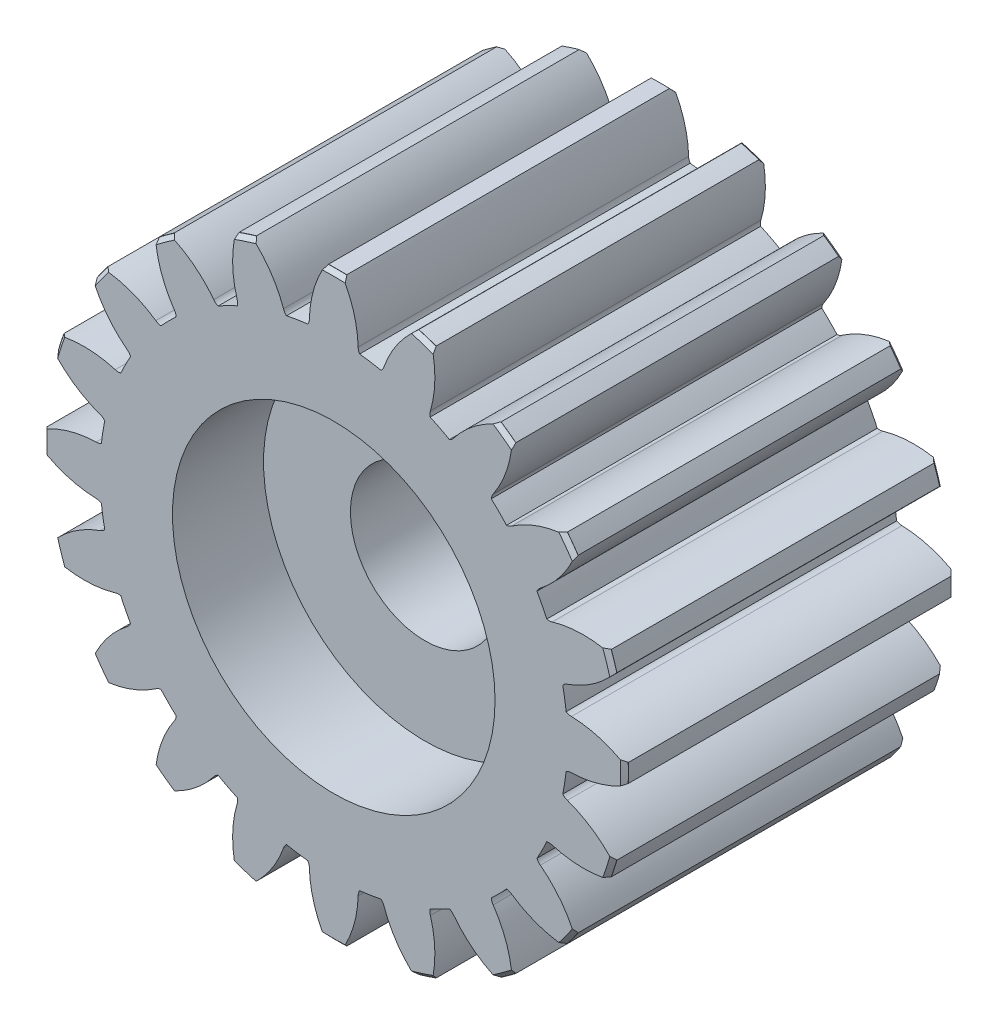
from build123d import *

# Parameters (mm, degrees)
SKETCH1_R           = 44.92
SKETCH1_R_2         = 14.3
BOSS_EXTRUDE1_DEPTH = 63.5
BOSS_EXTRUDE2_DEPTH = 63.5
CIRPATTERN1_COUNT   = 20
SKETCH5_W           = 30.99
SKETCH5_H           = 25


with BuildPart() as part:
    # Sketch1 → Boss-Extrude1 (new body)
    with BuildSketch(Plane.XY):
        Circle(SKETCH1_R)
        Circle(SKETCH1_R_2, mode=Mode.SUBTRACT)
    extrude(amount=-BOSS_EXTRUDE1_DEPTH)

    # Sketch2 → Boss-Extrude2 (add)
    with BuildSketch(Plane.XY):
        with BuildLine():
            ThreePointArc((1.75, 55.852590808), (0, 55.88), (-1.75, 55.852590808))
            ThreePointArc((-1.75, 55.852590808), (-3.864461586, 50.945060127), (-4.686520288, 45.665000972))
            ThreePointArc((-4.686520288, 45.665000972), (-4.757852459, 45.135935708), (-4.966601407, 44.644588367))
            ThreePointArc((-4.966601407, 44.644588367), (0, 44.92), (4.966601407, 44.644588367))
            ThreePointArc((4.966601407, 44.644588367), (4.757852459, 45.135935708), (4.686520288, 45.665000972))
            ThreePointArc((4.686520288, 45.665000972), (3.864461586, 50.945060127), (1.75, 55.852590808))
        make_face()
    boss_extrude2 = extrude(amount=-BOSS_EXTRUDE2_DEPTH)

    # CirPattern1: Boss-Extrude2 ×20 about axis
    cirpattern1_axis = Axis((0, 0, 0), (0, 0, 1))
    for i in range(1, CIRPATTERN1_COUNT):
        add(boss_extrude2.rotate(cirpattern1_axis, i * 360 / CIRPATTERN1_COUNT))

    # Sketch4 → Cut-Revolve1 (revolve, cut)
    with BuildSketch(Plane(origin=(0, 0, 0), x_dir=(1, 0, 0), z_dir=(0, 1, 0))):
        Polygon((55.851609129, 0.75), (55.101609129, 0), (56.282590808, 0), (56.282590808, 0.75), align=None)
    cut_revolve1 = revolve(axis=Axis((0, 0, -63.5), (0, 0, 1)), mode=Mode.SUBTRACT)

    # Mirror1: Cut-Revolve1 across plane
    add(cut_revolve1.mirror(Plane.XY.offset(-31.75)), mode=Mode.SUBTRACT)

    # Sketch5 → Cut-Revolve2 (revolve, cut)
    with BuildSketch(Plane(origin=(0, 0, 0), x_dir=(1, 0, 0), z_dir=(0, 1, 0))):
        with Locations((15.495, 58.5)):
            Rectangle(SKETCH5_W, SKETCH5_H)
    cut_revolve2 = revolve(axis=Axis((0, 0, 10.389951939), (0, 0, -1)), mode=Mode.SUBTRACT)

    # Mirror2: Cut-Revolve2 across plane
    add(cut_revolve2.mirror(Plane.XY.offset(-31.75)), mode=Mode.SUBTRACT)


solid = part.part
